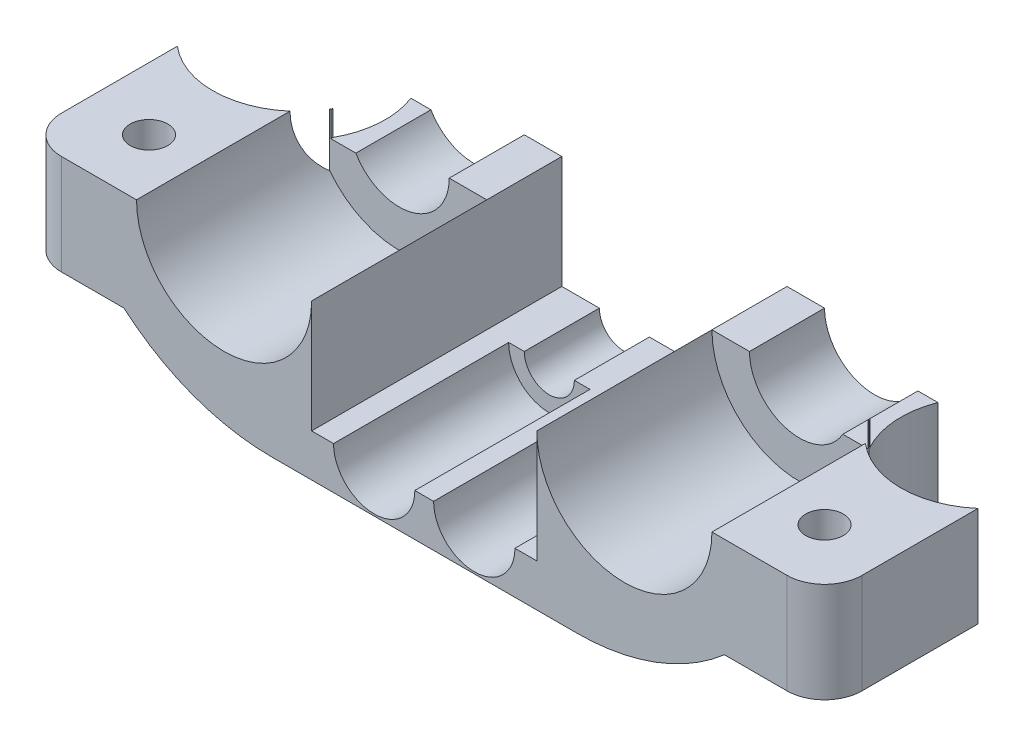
from build123d import *

# Parameters (mm, degrees)
BASE_EXTRUSION_DEPTH    = 20
ESQUISSE2_R             = 6.9
ESQUISSE2_R_2           = 1.5
ENL_V_MAT_EXTRU_1_DEPTH = 10
ESQUISSE3_R             = 3.5
ENL_V_MAT_EXTRU_2_DEPTH = 3
ESQUISSE4_R             = 7
ESQUISSE4_R_2           = 3.25
ENL_V_MAT_EXTRU_3_DEPTH = 14
CONG_1_R                = 3


with BuildPart() as part:
    # Esquisse1 → Base-Extrusion (new body)
    with BuildSketch(Plane.XY):
        with BuildLine():
            Line((-32, 12.4), (-21.464101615, 12.4))
            Line((-21.464101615, 12.4), (-21.464101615, 10.4))
            Line((-21.464101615, 10.4), (-19.464101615, 10.4))
            ThreePointArc((-19.464101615, 10.4), (-14.96472382, 8.536296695), (-12, 12.4))
            Line((-12, 12.4), (-9, 12.4))
            Line((-9, 12.4), (-9, 3.4))
            Line((-9, 3.4), (-6, 3.4))
            ThreePointArc((-6, 3.4), (-4, 1.4), (-2, 3.4))
            Line((-2, 3.4), (2, 3.4))
            ThreePointArc((2, 3.4), (4, 1.4), (6, 3.4))
            Line((6, 3.4), (9, 3.4))
            Line((9, 3.4), (9, 12.4))
            Line((9, 12.4), (12, 12.4))
            ThreePointArc((12, 12.4), (14.96472382, 8.536296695), (19.464101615, 10.4))
            Line((19.464101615, 10.4), (21.464101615, 10.4))
            Line((21.464101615, 10.4), (21.464101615, 12.4))
            Line((21.464101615, 12.4), (32, 12.4))
            Line((32, 12.4), (32, 4.4))
            Line((32, 4.4), (24, 4.4))
            ThreePointArc((24, 4.4), (18.501330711, 1.135836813), (12.208477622, 0))
            Line((12.208477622, 0), (-12.208477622, 0))
            ThreePointArc((-12.208477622, 0), (-18.501330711, 1.135836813), (-24, 4.4))
            Line((-24, 4.4), (-32, 4.4))
            Line((-32, 4.4), (-32, 12.4))
        make_face()
    extrude(amount=BASE_EXTRUSION_DEPTH)

    # Esquisse2 → Enl_v. mat.-Extru.1 (cut, symmetric)
    with BuildSketch(Plane.XZ.offset(-4.4)):
        with Locations((-27.5, 2.5)):
            Circle(ESQUISSE2_R)
        with Locations((27.5, 2.5)):
            Circle(ESQUISSE2_R)
        with Locations((27, 15)):
            Circle(ESQUISSE2_R_2)
        with Locations((-27, 15)):
            Circle(ESQUISSE2_R_2)
    extrude(amount=ENL_V_MAT_EXTRU_1_DEPTH, both=True, mode=Mode.SUBTRACT)

    # Esquisse3 → Enl_v. mat.-Extru.2 (cut)
    with BuildSketch(Plane.XZ.offset(-4.4)):
        with Locations((-27, 15)):
            Circle(ESQUISSE3_R)
        with Locations((27, 15)):
            Circle(ESQUISSE3_R)
    extrude(amount=-ENL_V_MAT_EXTRU_2_DEPTH, mode=Mode.SUBTRACT)

    # Esquisse4 → Enl_v. mat.-Extru.3 (cut)
    with BuildSketch(Plane.XY.offset(20)):
        with Locations((-16, 12.4)):
            Circle(ESQUISSE4_R)
        with Locations((16, 12.4)):
            Circle(ESQUISSE4_R)
        with Locations((-4, 3.4)):
            Circle(ESQUISSE4_R_2)
        with Locations((4, 3.4)):
            Circle(ESQUISSE4_R_2)
    extrude(amount=-ENL_V_MAT_EXTRU_3_DEPTH, mode=Mode.SUBTRACT)

    # Cong_1
    cong_1_edges = [part.edges().sort_by_distance(p)[0] for p in [
        (32, 8.4, 20),
        (-32, 8.4, 20),
    ]]
    fillet(cong_1_edges, radius=CONG_1_R)


solid = part.part
